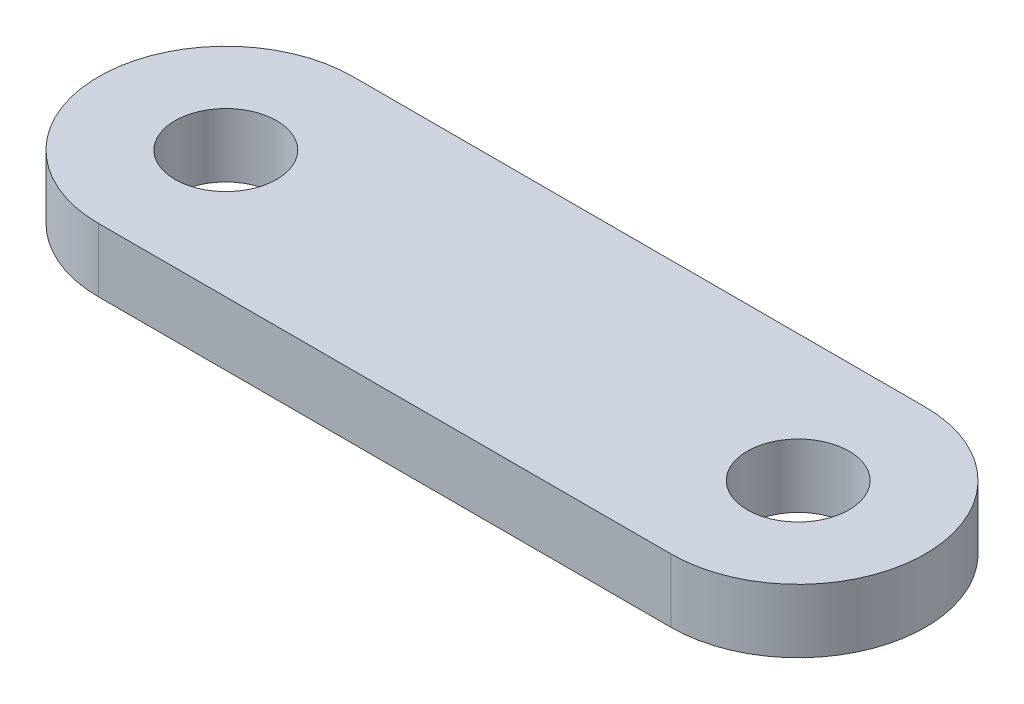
from build123d import *

# Parameters (mm, degrees)
SKETCH_1_R      = 1.6
EXTRUDE_1_DEPTH = 2


with BuildPart() as part:
    # Sketch 1 → Extrude 1 (new body)
    with BuildSketch(Plane(origin=(0, 0, 0), x_dir=(1, 0, 0), z_dir=(0, 1, 0))):
        with BuildLine():
            Line((0, 0), (18, 0))
            ThreePointArc((18, 0), (22, -4), (18, -8))
            Line((18, -8), (0, -8))
            ThreePointArc((0, -8), (-4, -4), (0, 0))
        make_face()
        with Locations(Location((0, -4, 0), (0, 0, 270))):
            Circle(SKETCH_1_R, mode=Mode.SUBTRACT)
        with Locations(Location((18, -4, 0), (0, 0, 270))):
            Circle(SKETCH_1_R, mode=Mode.SUBTRACT)
    extrude(amount=EXTRUDE_1_DEPTH)


solid = part.part
